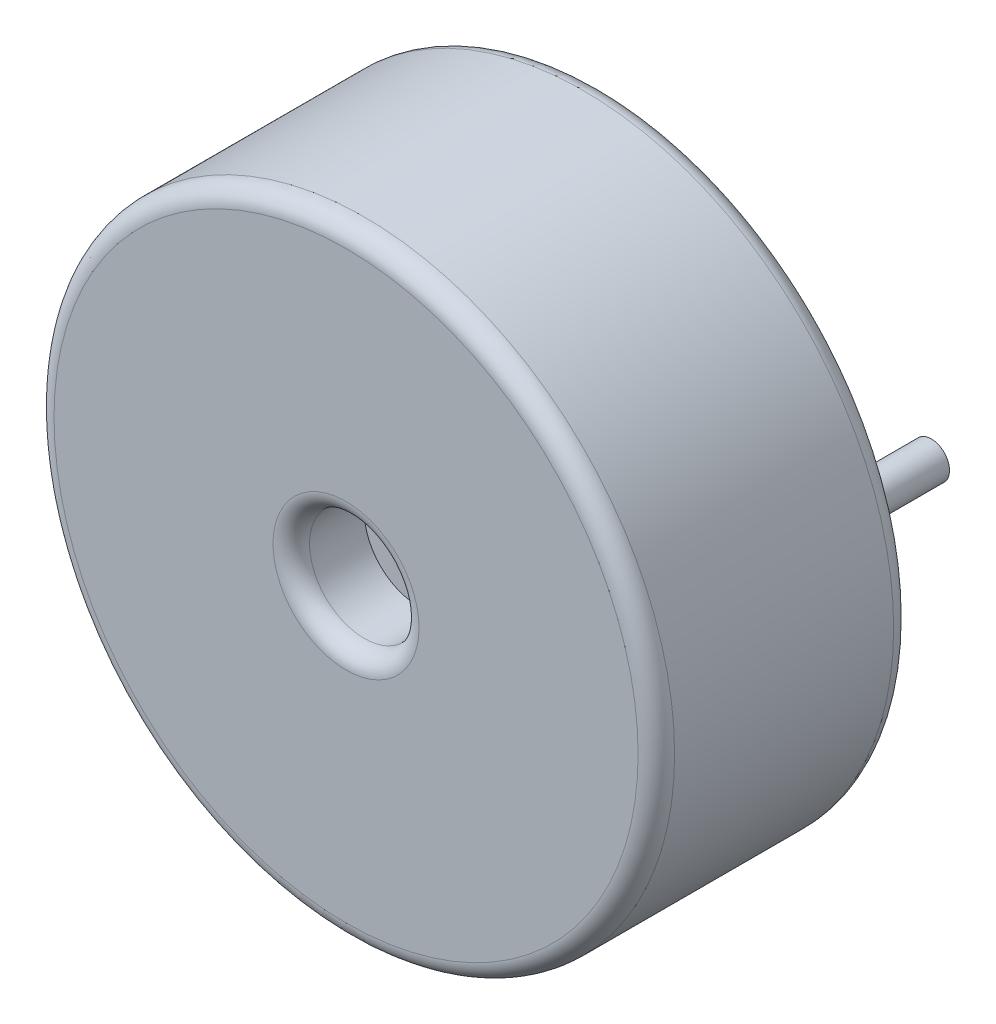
from build123d import *

# Parameters (mm, degrees)
ESQUISSE1_R             = 8.5
EXTRUSION1_DEPTH        = 7
ESQUISSE2_R             = 1.5
ENL_V_MAT_EXTRU_1_DEPTH = 2
ESQUISSE3_R             = 0.5
EXTRUSION2_DEPTH        = 4
CONG_1_R                = 0.5


with BuildPart() as part:
    # Esquisse1 → Extrusion1 (new body)
    with BuildSketch(Plane.XY):
        Circle(ESQUISSE1_R)
    extrude(amount=EXTRUSION1_DEPTH)

    # Esquisse2 → Enl_v. mat.-Extru.1 (cut)
    with BuildSketch(Plane.XY.offset(7)):
        Circle(ESQUISSE2_R)
    extrude(amount=-ENL_V_MAT_EXTRU_1_DEPTH, mode=Mode.SUBTRACT)

    # Esquisse3 → Extrusion2 (add)
    with BuildSketch(Plane(origin=(0, 0, 0), x_dir=(-1, 0, 0), z_dir=(0, 0, -1))):
        with Locations(Location((-5.03, 0, 0), (0, 0, 180))):
            Circle(ESQUISSE3_R)
        with Locations(Location((5.03, 0, 0), (0, 0, 180))):
            Circle(ESQUISSE3_R)
    extrude(amount=EXTRUSION2_DEPTH)

    # Cong_1
    cong_1_edges = [part.edges().sort_by_distance(p)[0] for p in [
        (-8.5, 0, 0),
        (-8.5, 0, 7),
        (-1.5, 0, 7),
    ]]
    fillet(cong_1_edges, radius=CONG_1_R)


solid = part.part
